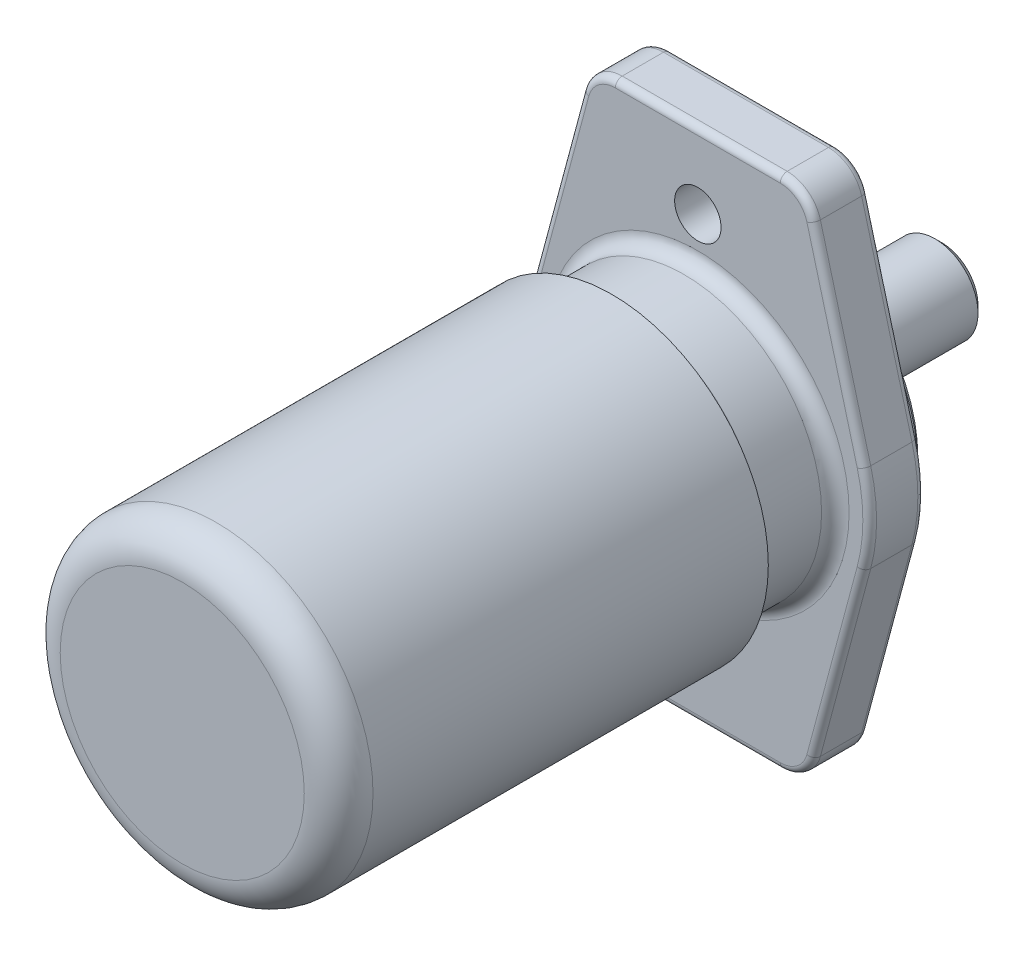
ISO-10303-21;
HEADER;
FILE_DESCRIPTION(('STEP AP214'),'2;1');
FILE_NAME('part.step','',(''),(''),'','','');
FILE_SCHEMA(('AUTOMOTIVE_DESIGN { 1 0 10303 214 1 1 1 1 }'));
ENDSEC;
DATA;
#1=APPLICATION_CONTEXT('core data for automotive mechanical design processes');
#2=APPLICATION_PROTOCOL_DEFINITION('international standard','automotive_design',2000,#1);
#3=PRODUCT_CONTEXT('',#1,'mechanical');
#4=PRODUCT('Part','Part','',(#3));
#5=PRODUCT_RELATED_PRODUCT_CATEGORY('part','',(#4));
#6=PRODUCT_DEFINITION_FORMATION('','',#4);
#7=PRODUCT_DEFINITION_CONTEXT('part definition',#1,'design');
#8=PRODUCT_DEFINITION('design','',#6,#7);
#9=PRODUCT_DEFINITION_SHAPE('','',#8);
#10=(LENGTH_UNIT() NAMED_UNIT(*) SI_UNIT(.MILLI.,.METRE.));
#11=(NAMED_UNIT(*) PLANE_ANGLE_UNIT() SI_UNIT($,.RADIAN.));
#12=(NAMED_UNIT(*) SI_UNIT($,.STERADIAN.) SOLID_ANGLE_UNIT());
#13=UNCERTAINTY_MEASURE_WITH_UNIT(LENGTH_MEASURE(1.E-05),#10,'distance_accuracy_value','');
#14=(GEOMETRIC_REPRESENTATION_CONTEXT(3) GLOBAL_UNCERTAINTY_ASSIGNED_CONTEXT((#13)) GLOBAL_UNIT_ASSIGNED_CONTEXT((#10,
#11,#12)) REPRESENTATION_CONTEXT('',''));
#15=CARTESIAN_POINT('',(0.,0.,0.));
#16=DIRECTION('',(0.,0.,1.));
#17=DIRECTION('',(1.,0.,0.));
#18=AXIS2_PLACEMENT_3D('',#15,#16,#17);
#19=CARTESIAN_POINT('',(0.,0.,24.));
#20=DIRECTION('',(0.,0.,1.));
#21=DIRECTION('',(1.,0.,0.));
#22=AXIS2_PLACEMENT_3D('',#19,#20,#21);
#23=PLANE('',#22);
#24=DIRECTION('',(0.258819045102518,-0.965925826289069,0.));
#25=VECTOR('',#24,1.);
#26=CARTESIAN_POINT('',(-31.7217563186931,-67.0705523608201,24.));
#27=LINE('',#26,#25);
#28=CARTESIAN_POINT('',(-46.3644396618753,-12.4233141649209,24.));
#29=VERTEX_POINT('',#28);
#30=CARTESIAN_POINT('',(-31.7217563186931,-67.0705523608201,24.));
#31=VERTEX_POINT('',#30);
#32=EDGE_CURVE('E226',#29,#31,#27,.T.);
#33=ORIENTED_EDGE('',*,*,#32,.T.);
#34=CARTESIAN_POINT('',(-23.9943497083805,-65.,24.));
#35=DIRECTION('',(0.,0.,1.));
#36=DIRECTION('',(1.,0.,0.));
#37=AXIS2_PLACEMENT_3D('',#34,#35,#36);
#38=CIRCLE('',#37,8.);
#39=CARTESIAN_POINT('',(-23.9943497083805,-73.,24.));
#40=VERTEX_POINT('',#39);
#41=EDGE_CURVE('E240',#31,#40,#38,.T.);
#42=ORIENTED_EDGE('',*,*,#41,.T.);
#43=DIRECTION('',(1.,0.,0.));
#44=VECTOR('',#43,1.);
#45=CARTESIAN_POINT('',(23.9943497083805,-73.,24.));
#46=LINE('',#45,#44);
#47=CARTESIAN_POINT('',(23.9943497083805,-73.,24.));
#48=VERTEX_POINT('',#47);
#49=EDGE_CURVE('E238',#40,#48,#46,.T.);
#50=ORIENTED_EDGE('',*,*,#49,.T.);
#51=CARTESIAN_POINT('',(23.9943497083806,-65.,24.));
#52=DIRECTION('',(0.,0.,1.));
#53=DIRECTION('',(1.,0.,0.));
#54=AXIS2_PLACEMENT_3D('',#51,#52,#53);
#55=CIRCLE('',#54,7.99999999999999);
#56=CARTESIAN_POINT('',(31.7217563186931,-67.0705523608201,24.));
#57=VERTEX_POINT('',#56);
#58=EDGE_CURVE('E236',#48,#57,#55,.T.);
#59=ORIENTED_EDGE('',*,*,#58,.T.);
#60=DIRECTION('',(0.258819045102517,0.965925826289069,0.));
#61=VECTOR('',#60,1.);
#62=CARTESIAN_POINT('',(46.3644396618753,-12.4233141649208,24.));
#63=LINE('',#62,#61);
#64=CARTESIAN_POINT('',(46.3644396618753,-12.4233141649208,24.));
#65=VERTEX_POINT('',#64);
#66=EDGE_CURVE('E234',#57,#65,#63,.T.);
#67=ORIENTED_EDGE('',*,*,#66,.T.);
#68=CARTESIAN_POINT('',(0.,0.,24.));
#69=DIRECTION('',(0.,0.,1.));
#70=DIRECTION('',(1.,0.,0.));
#71=AXIS2_PLACEMENT_3D('',#68,#69,#70);
#72=CIRCLE('',#71,48.);
#73=CARTESIAN_POINT('',(46.3644396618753,12.4233141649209,24.));
#74=VERTEX_POINT('',#73);
#75=EDGE_CURVE('E232',#65,#74,#72,.T.);
#76=ORIENTED_EDGE('',*,*,#75,.T.);
#77=DIRECTION('',(-0.258819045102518,0.965925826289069,0.));
#78=VECTOR('',#77,1.);
#79=CARTESIAN_POINT('',(31.7217563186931,67.0705523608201,24.));
#80=LINE('',#79,#78);
#81=CARTESIAN_POINT('',(31.7217563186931,67.0705523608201,24.));
#82=VERTEX_POINT('',#81);
#83=EDGE_CURVE('E230',#74,#82,#80,.T.);
#84=ORIENTED_EDGE('',*,*,#83,.T.);
#85=CARTESIAN_POINT('',(23.9943497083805,65.,24.));
#86=DIRECTION('',(0.,0.,1.));
#87=DIRECTION('',(1.,0.,0.));
#88=AXIS2_PLACEMENT_3D('',#85,#86,#87);
#89=CIRCLE('',#88,8.);
#90=CARTESIAN_POINT('',(23.9943497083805,73.,24.));
#91=VERTEX_POINT('',#90);
#92=EDGE_CURVE('E228',#82,#91,#89,.T.);
#93=ORIENTED_EDGE('',*,*,#92,.T.);
#94=DIRECTION('',(-1.,0.,0.));
#95=VECTOR('',#94,1.);
#96=CARTESIAN_POINT('',(-23.9943497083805,73.,24.));
#97=LINE('',#96,#95);
#98=CARTESIAN_POINT('',(-23.9943497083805,73.,24.));
#99=VERTEX_POINT('',#98);
#100=EDGE_CURVE('E224',#91,#99,#97,.T.);
#101=ORIENTED_EDGE('',*,*,#100,.T.);
#102=CARTESIAN_POINT('',(-23.9943497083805,65.,24.));
#103=DIRECTION('',(0.,0.,1.));
#104=DIRECTION('',(1.,0.,0.));
#105=AXIS2_PLACEMENT_3D('',#102,#103,#104);
#106=CIRCLE('',#105,7.99999999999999);
#107=CARTESIAN_POINT('',(-31.7217563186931,67.0705523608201,24.));
#108=VERTEX_POINT('',#107);
#109=EDGE_CURVE('E199',#99,#108,#106,.T.);
#110=ORIENTED_EDGE('',*,*,#109,.T.);
#111=DIRECTION('',(-0.258819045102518,-0.965925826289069,0.));
#112=VECTOR('',#111,1.);
#113=CARTESIAN_POINT('',(-46.3644396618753,12.4233141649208,24.));
#114=LINE('',#113,#112);
#115=CARTESIAN_POINT('',(-46.3644396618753,12.4233141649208,24.));
#116=VERTEX_POINT('',#115);
#117=EDGE_CURVE('E191',#108,#116,#114,.T.);
#118=ORIENTED_EDGE('',*,*,#117,.T.);
#119=CARTESIAN_POINT('',(0.,0.,24.));
#120=DIRECTION('',(0.,0.,1.));
#121=DIRECTION('',(1.,0.,0.));
#122=AXIS2_PLACEMENT_3D('',#119,#120,#121);
#123=CIRCLE('',#122,48.);
#124=EDGE_CURVE('E196',#116,#29,#123,.T.);
#125=ORIENTED_EDGE('',*,*,#124,.T.);
#126=EDGE_LOOP('',(#33,#42,#50,#59,#67,#76,#84,#93,#101,#110,#118,#125));
#127=FACE_BOUND('',#126,.T.);
#128=CARTESIAN_POINT('',(0.,0.,24.));
#129=DIRECTION('',(0.,0.,1.));
#130=DIRECTION('',(1.,0.,0.));
#131=AXIS2_PLACEMENT_3D('',#128,#129,#130);
#132=CIRCLE('',#131,44.);
#133=CARTESIAN_POINT('',(44.,0.,24.));
#134=VERTEX_POINT('',#133);
#135=EDGE_CURVE('E219',#134,#134,#132,.F.);
#136=ORIENTED_EDGE('',*,*,#135,.T.);
#137=EDGE_LOOP('',(#136));
#138=FACE_BOUND('',#137,.T.);
#139=CARTESIAN_POINT('',(0.,-53.2,24.));
#140=DIRECTION('',(0.,0.,1.));
#141=DIRECTION('',(1.,0.,0.));
#142=AXIS2_PLACEMENT_3D('',#139,#140,#141);
#143=CIRCLE('',#142,6.75);
#144=CARTESIAN_POINT('',(6.75,-53.2,24.));
#145=VERTEX_POINT('',#144);
#146=EDGE_CURVE('E530',#145,#145,#143,.T.);
#147=ORIENTED_EDGE('',*,*,#146,.F.);
#148=EDGE_LOOP('',(#147));
#149=FACE_BOUND('',#148,.T.);
#150=CARTESIAN_POINT('',(0.,53.2,24.));
#151=DIRECTION('',(0.,0.,1.));
#152=DIRECTION('',(1.,0.,0.));
#153=AXIS2_PLACEMENT_3D('',#150,#151,#152);
#154=CIRCLE('',#153,6.75);
#155=CARTESIAN_POINT('',(6.75,53.2,24.));
#156=VERTEX_POINT('',#155);
#157=EDGE_CURVE('E458',#156,#156,#154,.T.);
#158=ORIENTED_EDGE('',*,*,#157,.F.);
#159=EDGE_LOOP('',(#158));
#160=FACE_BOUND('',#159,.T.);
#161=ADVANCED_FACE('F29',(#127,#138,#149,#160),#23,.T.);
#162=CARTESIAN_POINT('',(0.,0.,0.));
#163=DIRECTION('',(0.,0.,1.));
#164=DIRECTION('',(1.,0.,0.));
#165=AXIS2_PLACEMENT_3D('',#162,#163,#164);
#166=PLANE('',#165);
#167=CARTESIAN_POINT('',(0.,0.,0.));
#168=DIRECTION('',(0.,0.,1.));
#169=DIRECTION('',(1.,0.,0.));
#170=AXIS2_PLACEMENT_3D('',#167,#168,#169);
#171=CIRCLE('',#170,14.5);
#172=CARTESIAN_POINT('',(14.5,0.,0.));
#173=VERTEX_POINT('',#172);
#174=EDGE_CURVE('E323',#173,#173,#171,.T.);
#175=ORIENTED_EDGE('',*,*,#174,.T.);
#176=EDGE_LOOP('',(#175));
#177=FACE_BOUND('',#176,.T.);
#178=CARTESIAN_POINT('',(0.,0.,0.));
#179=DIRECTION('',(0.,0.,1.));
#180=DIRECTION('',(1.,0.,0.));
#181=AXIS2_PLACEMENT_3D('',#178,#179,#180);
#182=CIRCLE('',#181,40.);
#183=CARTESIAN_POINT('',(40.,0.,0.));
#184=VERTEX_POINT('',#183);
#185=EDGE_CURVE('E320',#184,#184,#182,.F.);
#186=ORIENTED_EDGE('',*,*,#185,.T.);
#187=EDGE_LOOP('',(#186));
#188=FACE_BOUND('',#187,.T.);
#189=ADVANCED_FACE('F347',(#177,#188),#166,.F.);
#190=CARTESIAN_POINT('',(0.,0.,8.));
#191=DIRECTION('',(0.,0.,-1.));
#192=DIRECTION('',(-1.,0.,0.));
#193=AXIS2_PLACEMENT_3D('',#190,#191,#192);
#194=CYLINDRICAL_SURFACE('',#193,42.);
#195=CARTESIAN_POINT('',(0.,0.,2.));
#196=DIRECTION('',(0.,0.,1.));
#197=DIRECTION('',(1.,0.,0.));
#198=AXIS2_PLACEMENT_3D('',#195,#196,#197);
#199=CIRCLE('',#198,42.);
#200=CARTESIAN_POINT('',(42.,0.,2.));
#201=VERTEX_POINT('',#200);
#202=EDGE_CURVE('E11',#201,#201,#199,.T.);
#203=ORIENTED_EDGE('',*,*,#202,.T.);
#204=EDGE_LOOP('',(#203));
#205=FACE_BOUND('',#204,.T.);
#206=CARTESIAN_POINT('',(0.,0.,8.));
#207=DIRECTION('',(0.,0.,1.));
#208=DIRECTION('',(1.,0.,0.));
#209=AXIS2_PLACEMENT_3D('',#206,#207,#208);
#210=CIRCLE('',#209,42.);
#211=CARTESIAN_POINT('',(42.,0.,8.));
#212=VERTEX_POINT('',#211);
#213=EDGE_CURVE('E416',#212,#212,#210,.T.);
#214=ORIENTED_EDGE('',*,*,#213,.F.);
#215=EDGE_LOOP('',(#214));
#216=FACE_BOUND('',#215,.T.);
#217=ADVANCED_FACE('F31',(#205,#216),#194,.T.);
#218=CARTESIAN_POINT('',(0.,0.,8.));
#219=DIRECTION('',(0.,0.,1.));
#220=DIRECTION('',(1.,0.,0.));
#221=AXIS2_PLACEMENT_3D('',#218,#219,#220);
#222=PLANE('',#221);
#223=DIRECTION('',(1.,0.,0.));
#224=VECTOR('',#223,1.);
#225=CARTESIAN_POINT('',(0.,-73.,8.));
#226=LINE('',#225,#224);
#227=CARTESIAN_POINT('',(23.9943497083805,-73.,8.));
#228=VERTEX_POINT('',#227);
#229=CARTESIAN_POINT('',(-23.9943497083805,-73.,8.));
#230=VERTEX_POINT('',#229);
#231=EDGE_CURVE('E269',#228,#230,#226,.F.);
#232=ORIENTED_EDGE('',*,*,#231,.T.);
#233=CARTESIAN_POINT('',(-23.9943497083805,-65.,8.));
#234=DIRECTION('',(0.,0.,1.));
#235=DIRECTION('',(1.,0.,0.));
#236=AXIS2_PLACEMENT_3D('',#233,#234,#235);
#237=CIRCLE('',#236,8.);
#238=CARTESIAN_POINT('',(-31.7217563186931,-67.0705523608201,8.));
#239=VERTEX_POINT('',#238);
#240=EDGE_CURVE('E271',#230,#239,#237,.F.);
#241=ORIENTED_EDGE('',*,*,#240,.T.);
#242=DIRECTION('',(0.258819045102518,-0.965925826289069,0.));
#243=VECTOR('',#242,1.);
#244=CARTESIAN_POINT('',(-46.3644396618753,-12.4233141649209,8.));
#245=LINE('',#244,#243);
#246=CARTESIAN_POINT('',(-46.3644396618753,-12.4233141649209,8.));
#247=VERTEX_POINT('',#246);
#248=EDGE_CURVE('E256',#239,#247,#245,.F.);
#249=ORIENTED_EDGE('',*,*,#248,.T.);
#250=CARTESIAN_POINT('',(0.,0.,8.));
#251=DIRECTION('',(0.,0.,1.));
#252=DIRECTION('',(1.,0.,0.));
#253=AXIS2_PLACEMENT_3D('',#250,#251,#252);
#254=CIRCLE('',#253,48.);
#255=CARTESIAN_POINT('',(-46.3644396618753,12.4233141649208,8.));
#256=VERTEX_POINT('',#255);
#257=EDGE_CURVE('E248',#247,#256,#254,.F.);
#258=ORIENTED_EDGE('',*,*,#257,.T.);
#259=DIRECTION('',(-0.258819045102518,-0.965925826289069,0.));
#260=VECTOR('',#259,1.);
#261=CARTESIAN_POINT('',(-46.3644396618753,12.4233141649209,8.));
#262=LINE('',#261,#260);
#263=CARTESIAN_POINT('',(-31.7217563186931,67.0705523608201,8.));
#264=VERTEX_POINT('',#263);
#265=EDGE_CURVE('E250',#256,#264,#262,.F.);
#266=ORIENTED_EDGE('',*,*,#265,.T.);
#267=CARTESIAN_POINT('',(-23.9943497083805,65.,8.));
#268=DIRECTION('',(0.,0.,1.));
#269=DIRECTION('',(1.,0.,0.));
#270=AXIS2_PLACEMENT_3D('',#267,#268,#269);
#271=CIRCLE('',#270,7.99999999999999);
#272=CARTESIAN_POINT('',(-23.9943497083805,73.,8.));
#273=VERTEX_POINT('',#272);
#274=EDGE_CURVE('E252',#264,#273,#271,.F.);
#275=ORIENTED_EDGE('',*,*,#274,.T.);
#276=DIRECTION('',(-1.,0.,0.));
#277=VECTOR('',#276,1.);
#278=CARTESIAN_POINT('',(0.,73.,8.));
#279=LINE('',#278,#277);
#280=CARTESIAN_POINT('',(23.9943497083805,73.,8.));
#281=VERTEX_POINT('',#280);
#282=EDGE_CURVE('E254',#273,#281,#279,.F.);
#283=ORIENTED_EDGE('',*,*,#282,.T.);
#284=CARTESIAN_POINT('',(23.9943497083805,65.,8.));
#285=DIRECTION('',(0.,0.,1.));
#286=DIRECTION('',(1.,0.,0.));
#287=AXIS2_PLACEMENT_3D('',#284,#285,#286);
#288=CIRCLE('',#287,8.);
#289=CARTESIAN_POINT('',(31.7217563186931,67.0705523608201,8.));
#290=VERTEX_POINT('',#289);
#291=EDGE_CURVE('E259',#281,#290,#288,.F.);
#292=ORIENTED_EDGE('',*,*,#291,.T.);
#293=DIRECTION('',(-0.258819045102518,0.965925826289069,0.));
#294=VECTOR('',#293,1.);
#295=CARTESIAN_POINT('',(46.3644396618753,12.4233141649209,8.));
#296=LINE('',#295,#294);
#297=CARTESIAN_POINT('',(46.3644396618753,12.4233141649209,8.));
#298=VERTEX_POINT('',#297);
#299=EDGE_CURVE('E261',#290,#298,#296,.F.);
#300=ORIENTED_EDGE('',*,*,#299,.T.);
#301=CARTESIAN_POINT('',(0.,0.,8.));
#302=DIRECTION('',(0.,0.,1.));
#303=DIRECTION('',(1.,0.,0.));
#304=AXIS2_PLACEMENT_3D('',#301,#302,#303);
#305=CIRCLE('',#304,48.);
#306=CARTESIAN_POINT('',(46.3644396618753,-12.4233141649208,8.));
#307=VERTEX_POINT('',#306);
#308=EDGE_CURVE('E263',#298,#307,#305,.F.);
#309=ORIENTED_EDGE('',*,*,#308,.T.);
#310=DIRECTION('',(0.258819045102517,0.965925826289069,0.));
#311=VECTOR('',#310,1.);
#312=CARTESIAN_POINT('',(46.3644396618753,-12.4233141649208,8.));
#313=LINE('',#312,#311);
#314=CARTESIAN_POINT('',(31.7217563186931,-67.0705523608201,8.));
#315=VERTEX_POINT('',#314);
#316=EDGE_CURVE('E265',#307,#315,#313,.F.);
#317=ORIENTED_EDGE('',*,*,#316,.T.);
#318=CARTESIAN_POINT('',(23.9943497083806,-65.,8.));
#319=DIRECTION('',(0.,0.,1.));
#320=DIRECTION('',(1.,0.,0.));
#321=AXIS2_PLACEMENT_3D('',#318,#319,#320);
#322=CIRCLE('',#321,7.99999999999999);
#323=EDGE_CURVE('E267',#315,#228,#322,.F.);
#324=ORIENTED_EDGE('',*,*,#323,.T.);
#325=EDGE_LOOP('',(#232,#241,#249,#258,#266,#275,#283,#292,#300,#309,#317,#324));
#326=FACE_BOUND('',#325,.T.);
#327=CARTESIAN_POINT('',(0.,-53.2,8.));
#328=DIRECTION('',(0.,0.,1.));
#329=DIRECTION('',(1.,0.,0.));
#330=AXIS2_PLACEMENT_3D('',#327,#328,#329);
#331=CIRCLE('',#330,6.75);
#332=CARTESIAN_POINT('',(6.75,-53.2,8.));
#333=VERTEX_POINT('',#332);
#334=EDGE_CURVE('E527',#333,#333,#331,.T.);
#335=ORIENTED_EDGE('',*,*,#334,.T.);
#336=EDGE_LOOP('',(#335));
#337=FACE_BOUND('',#336,.T.);
#338=CARTESIAN_POINT('',(0.,53.2,8.));
#339=DIRECTION('',(0.,0.,1.));
#340=DIRECTION('',(1.,0.,0.));
#341=AXIS2_PLACEMENT_3D('',#338,#339,#340);
#342=CIRCLE('',#341,6.75);
#343=CARTESIAN_POINT('',(6.75,53.2,8.));
#344=VERTEX_POINT('',#343);
#345=EDGE_CURVE('E536',#344,#344,#342,.T.);
#346=ORIENTED_EDGE('',*,*,#345,.T.);
#347=EDGE_LOOP('',(#346));
#348=FACE_BOUND('',#347,.T.);
#349=ORIENTED_EDGE('',*,*,#213,.T.);
#350=EDGE_LOOP('',(#349));
#351=FACE_BOUND('',#350,.T.);
#352=ADVANCED_FACE('F355',(#326,#337,#348,#351),#222,.F.);
#353=CARTESIAN_POINT('',(0.,0.,24.));
#354=DIRECTION('',(0.,0.,-1.));
#355=DIRECTION('',(-1.,0.,0.));
#356=AXIS2_PLACEMENT_3D('',#353,#354,#355);
#357=CYLINDRICAL_SURFACE('',#356,50.);
#358=DIRECTION('',(0.,0.,-1.));
#359=VECTOR('',#358,1.);
#360=CARTESIAN_POINT('',(48.2962913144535,12.9409522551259,24.));
#361=LINE('',#360,#359);
#362=CARTESIAN_POINT('',(48.2962913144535,12.9409522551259,22.));
#363=VERTEX_POINT('',#362);
#364=CARTESIAN_POINT('',(48.2962913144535,12.9409522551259,10.));
#365=VERTEX_POINT('',#364);
#366=EDGE_CURVE('E409',#363,#365,#361,.T.);
#367=ORIENTED_EDGE('',*,*,#366,.F.);
#368=CARTESIAN_POINT('',(0.,0.,22.));
#369=DIRECTION('',(0.,0.,1.));
#370=DIRECTION('',(1.,0.,0.));
#371=AXIS2_PLACEMENT_3D('',#368,#369,#370);
#372=CIRCLE('',#371,50.);
#373=CARTESIAN_POINT('',(48.2962913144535,-12.9409522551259,22.));
#374=VERTEX_POINT('',#373);
#375=EDGE_CURVE('E291',#363,#374,#372,.F.);
#376=ORIENTED_EDGE('',*,*,#375,.T.);
#377=DIRECTION('',(0.,0.,-1.));
#378=VECTOR('',#377,1.);
#379=CARTESIAN_POINT('',(48.2962913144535,-12.9409522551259,24.));
#380=LINE('',#379,#378);
#381=CARTESIAN_POINT('',(48.2962913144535,-12.9409522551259,10.));
#382=VERTEX_POINT('',#381);
#383=EDGE_CURVE('E450',#374,#382,#380,.T.);
#384=ORIENTED_EDGE('',*,*,#383,.T.);
#385=CARTESIAN_POINT('',(0.,0.,10.));
#386=DIRECTION('',(0.,0.,1.));
#387=DIRECTION('',(1.,0.,0.));
#388=AXIS2_PLACEMENT_3D('',#385,#386,#387);
#389=CIRCLE('',#388,50.);
#390=EDGE_CURVE('E289',#382,#365,#389,.T.);
#391=ORIENTED_EDGE('',*,*,#390,.T.);
#392=EDGE_LOOP('',(#367,#376,#384,#391));
#393=FACE_BOUND('',#392,.T.);
#394=ADVANCED_FACE('F399',(#393),#357,.T.);
#395=CARTESIAN_POINT('',(33.6536079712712,67.5881904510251,24.));
#396=DIRECTION('',(-0.965925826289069,-0.258819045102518,0.));
#397=DIRECTION('',(0.258819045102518,-0.965925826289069,0.));
#398=AXIS2_PLACEMENT_3D('',#395,#396,#397);
#399=PLANE('',#398);
#400=DIRECTION('',(0.,0.,-1.));
#401=VECTOR('',#400,1.);
#402=CARTESIAN_POINT('',(33.6536079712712,67.5881904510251,24.));
#403=LINE('',#402,#401);
#404=CARTESIAN_POINT('',(33.6536079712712,67.5881904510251,22.));
#405=VERTEX_POINT('',#404);
#406=CARTESIAN_POINT('',(33.6536079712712,67.5881904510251,10.));
#407=VERTEX_POINT('',#406);
#408=EDGE_CURVE('E417',#405,#407,#403,.T.);
#409=ORIENTED_EDGE('',*,*,#408,.F.);
#410=DIRECTION('',(-0.258819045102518,0.965925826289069,0.));
#411=VECTOR('',#410,1.);
#412=CARTESIAN_POINT('',(48.2962913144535,12.9409522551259,22.));
#413=LINE('',#412,#411);
#414=EDGE_CURVE('E295',#405,#363,#413,.F.);
#415=ORIENTED_EDGE('',*,*,#414,.T.);
#416=ORIENTED_EDGE('',*,*,#366,.T.);
#417=DIRECTION('',(-0.258819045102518,0.965925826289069,0.));
#418=VECTOR('',#417,1.);
#419=CARTESIAN_POINT('',(33.6536079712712,67.5881904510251,10.));
#420=LINE('',#419,#418);
#421=EDGE_CURVE('E293',#365,#407,#420,.T.);
#422=ORIENTED_EDGE('',*,*,#421,.T.);
#423=EDGE_LOOP('',(#409,#415,#416,#422));
#424=FACE_BOUND('',#423,.T.);
#425=ADVANCED_FACE('F395',(#424),#399,.F.);
#426=CARTESIAN_POINT('',(23.9943497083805,65.,24.));
#427=DIRECTION('',(0.,0.,-1.));
#428=DIRECTION('',(-1.,0.,0.));
#429=AXIS2_PLACEMENT_3D('',#426,#427,#428);
#430=CYLINDRICAL_SURFACE('',#429,10.);
#431=DIRECTION('',(0.,0.,-1.));
#432=VECTOR('',#431,1.);
#433=CARTESIAN_POINT('',(23.9943497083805,75.,24.));
#434=LINE('',#433,#432);
#435=CARTESIAN_POINT('',(23.9943497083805,75.,22.));
#436=VERTEX_POINT('',#435);
#437=CARTESIAN_POINT('',(23.9943497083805,75.,10.));
#438=VERTEX_POINT('',#437);
#439=EDGE_CURVE('E477',#436,#438,#434,.T.);
#440=ORIENTED_EDGE('',*,*,#439,.F.);
#441=CARTESIAN_POINT('',(23.9943497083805,65.,22.));
#442=DIRECTION('',(0.,0.,1.));
#443=DIRECTION('',(1.,0.,0.));
#444=AXIS2_PLACEMENT_3D('',#441,#442,#443);
#445=CIRCLE('',#444,10.);
#446=EDGE_CURVE('E303',#436,#405,#445,.F.);
#447=ORIENTED_EDGE('',*,*,#446,.T.);
#448=ORIENTED_EDGE('',*,*,#408,.T.);
#449=CARTESIAN_POINT('',(23.9943497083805,65.,10.));
#450=DIRECTION('',(0.,0.,1.));
#451=DIRECTION('',(1.,0.,0.));
#452=AXIS2_PLACEMENT_3D('',#449,#450,#451);
#453=CIRCLE('',#452,10.);
#454=EDGE_CURVE('E301',#407,#438,#453,.T.);
#455=ORIENTED_EDGE('',*,*,#454,.T.);
#456=EDGE_LOOP('',(#440,#447,#448,#455));
#457=FACE_BOUND('',#456,.T.);
#458=ADVANCED_FACE('F391',(#457),#430,.T.);
#459=CARTESIAN_POINT('',(-23.9943497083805,75.,24.));
#460=DIRECTION('',(0.,-1.,0.));
#461=DIRECTION('',(1.,0.,0.));
#462=AXIS2_PLACEMENT_3D('',#459,#460,#461);
#463=PLANE('',#462);
#464=DIRECTION('',(0.,0.,-1.));
#465=VECTOR('',#464,1.);
#466=CARTESIAN_POINT('',(-23.9943497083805,75.,24.));
#467=LINE('',#466,#465);
#468=CARTESIAN_POINT('',(-23.9943497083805,75.,22.));
#469=VERTEX_POINT('',#468);
#470=CARTESIAN_POINT('',(-23.9943497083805,75.,10.));
#471=VERTEX_POINT('',#470);
#472=EDGE_CURVE('E474',#469,#471,#467,.T.);
#473=ORIENTED_EDGE('',*,*,#472,.F.);
#474=DIRECTION('',(-1.,0.,0.));
#475=VECTOR('',#474,1.);
#476=CARTESIAN_POINT('',(23.9943497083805,75.,22.));
#477=LINE('',#476,#475);
#478=EDGE_CURVE('E299',#469,#436,#477,.F.);
#479=ORIENTED_EDGE('',*,*,#478,.T.);
#480=ORIENTED_EDGE('',*,*,#439,.T.);
#481=DIRECTION('',(-1.,0.,0.));
#482=VECTOR('',#481,1.);
#483=CARTESIAN_POINT('',(-23.9943497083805,75.,10.));
#484=LINE('',#483,#482);
#485=EDGE_CURVE('E297',#438,#471,#484,.T.);
#486=ORIENTED_EDGE('',*,*,#485,.T.);
#487=EDGE_LOOP('',(#473,#479,#480,#486));
#488=FACE_BOUND('',#487,.T.);
#489=ADVANCED_FACE('F387',(#488),#463,.F.);
#490=CARTESIAN_POINT('',(-23.9943497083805,65.,24.));
#491=DIRECTION('',(0.,0.,-1.));
#492=DIRECTION('',(-1.,0.,0.));
#493=AXIS2_PLACEMENT_3D('',#490,#491,#492);
#494=CYLINDRICAL_SURFACE('',#493,9.99999999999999);
#495=DIRECTION('',(0.,0.,-1.));
#496=VECTOR('',#495,1.);
#497=CARTESIAN_POINT('',(-33.6536079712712,67.5881904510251,24.));
#498=LINE('',#497,#496);
#499=CARTESIAN_POINT('',(-33.6536079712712,67.5881904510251,22.));
#500=VERTEX_POINT('',#499);
#501=CARTESIAN_POINT('',(-33.6536079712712,67.5881904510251,10.));
#502=VERTEX_POINT('',#501);
#503=EDGE_CURVE('E472',#500,#502,#498,.T.);
#504=ORIENTED_EDGE('',*,*,#503,.F.);
#505=CARTESIAN_POINT('',(-23.9943497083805,65.,22.));
#506=DIRECTION('',(0.,0.,1.));
#507=DIRECTION('',(1.,0.,0.));
#508=AXIS2_PLACEMENT_3D('',#505,#506,#507);
#509=CIRCLE('',#508,9.99999999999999);
#510=EDGE_CURVE('E307',#500,#469,#509,.F.);
#511=ORIENTED_EDGE('',*,*,#510,.T.);
#512=ORIENTED_EDGE('',*,*,#472,.T.);
#513=CARTESIAN_POINT('',(-23.9943497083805,65.,10.));
#514=DIRECTION('',(0.,0.,1.));
#515=DIRECTION('',(1.,0.,0.));
#516=AXIS2_PLACEMENT_3D('',#513,#514,#515);
#517=CIRCLE('',#516,9.99999999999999);
#518=EDGE_CURVE('E305',#471,#502,#517,.T.);
#519=ORIENTED_EDGE('',*,*,#518,.T.);
#520=EDGE_LOOP('',(#504,#511,#512,#519));
#521=FACE_BOUND('',#520,.T.);
#522=ADVANCED_FACE('F384',(#521),#494,.T.);
#523=CARTESIAN_POINT('',(-48.2962913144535,12.9409522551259,24.));
#524=DIRECTION('',(0.965925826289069,-0.258819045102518,0.));
#525=DIRECTION('',(0.258819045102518,0.965925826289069,0.));
#526=AXIS2_PLACEMENT_3D('',#523,#524,#525);
#527=PLANE('',#526);
#528=DIRECTION('',(0.,0.,-1.));
#529=VECTOR('',#528,1.);
#530=CARTESIAN_POINT('',(-48.2962913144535,12.9409522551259,24.));
#531=LINE('',#530,#529);
#532=CARTESIAN_POINT('',(-48.2962913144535,12.9409522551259,22.));
#533=VERTEX_POINT('',#532);
#534=CARTESIAN_POINT('',(-48.2962913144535,12.9409522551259,10.));
#535=VERTEX_POINT('',#534);
#536=EDGE_CURVE('E470',#533,#535,#531,.T.);
#537=ORIENTED_EDGE('',*,*,#536,.F.);
#538=DIRECTION('',(-0.258819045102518,-0.965925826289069,0.));
#539=VECTOR('',#538,1.);
#540=CARTESIAN_POINT('',(-33.6536079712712,67.5881904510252,22.));
#541=LINE('',#540,#539);
#542=EDGE_CURVE('E208',#533,#500,#541,.F.);
#543=ORIENTED_EDGE('',*,*,#542,.T.);
#544=ORIENTED_EDGE('',*,*,#503,.T.);
#545=DIRECTION('',(-0.258819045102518,-0.965925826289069,0.));
#546=VECTOR('',#545,1.);
#547=CARTESIAN_POINT('',(-48.2962913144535,12.9409522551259,10.));
#548=LINE('',#547,#546);
#549=EDGE_CURVE('E44',#502,#535,#548,.T.);
#550=ORIENTED_EDGE('',*,*,#549,.T.);
#551=EDGE_LOOP('',(#537,#543,#544,#550));
#552=FACE_BOUND('',#551,.T.);
#553=ADVANCED_FACE('F381',(#552),#527,.F.);
#554=CARTESIAN_POINT('',(0.,0.,24.));
#555=DIRECTION('',(0.,0.,-1.));
#556=DIRECTION('',(-1.,0.,0.));
#557=AXIS2_PLACEMENT_3D('',#554,#555,#556);
#558=CYLINDRICAL_SURFACE('',#557,50.);
#559=DIRECTION('',(0.,0.,-1.));
#560=VECTOR('',#559,1.);
#561=CARTESIAN_POINT('',(-48.2962913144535,-12.9409522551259,24.));
#562=LINE('',#561,#560);
#563=CARTESIAN_POINT('',(-48.2962913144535,-12.9409522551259,22.));
#564=VERTEX_POINT('',#563);
#565=CARTESIAN_POINT('',(-48.2962913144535,-12.9409522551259,10.));
#566=VERTEX_POINT('',#565);
#567=EDGE_CURVE('E467',#564,#566,#562,.T.);
#568=ORIENTED_EDGE('',*,*,#567,.F.);
#569=CARTESIAN_POINT('',(0.,0.,22.));
#570=DIRECTION('',(0.,0.,1.));
#571=DIRECTION('',(1.,0.,0.));
#572=AXIS2_PLACEMENT_3D('',#569,#570,#571);
#573=CIRCLE('',#572,50.);
#574=EDGE_CURVE('E51',#564,#533,#573,.F.);
#575=ORIENTED_EDGE('',*,*,#574,.T.);
#576=ORIENTED_EDGE('',*,*,#536,.T.);
#577=CARTESIAN_POINT('',(0.,0.,10.));
#578=DIRECTION('',(0.,0.,1.));
#579=DIRECTION('',(1.,0.,0.));
#580=AXIS2_PLACEMENT_3D('',#577,#578,#579);
#581=CIRCLE('',#580,50.);
#582=EDGE_CURVE('E311',#535,#566,#581,.T.);
#583=ORIENTED_EDGE('',*,*,#582,.T.);
#584=EDGE_LOOP('',(#568,#575,#576,#583));
#585=FACE_BOUND('',#584,.T.);
#586=ADVANCED_FACE('F377',(#585),#558,.T.);
#587=CARTESIAN_POINT('',(-48.2962913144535,-12.9409522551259,24.));
#588=DIRECTION('',(0.965925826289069,0.258819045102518,0.));
#589=DIRECTION('',(-0.258819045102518,0.965925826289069,0.));
#590=AXIS2_PLACEMENT_3D('',#587,#588,#589);
#591=PLANE('',#590);
#592=DIRECTION('',(0.,0.,-1.));
#593=VECTOR('',#592,1.);
#594=CARTESIAN_POINT('',(-33.6536079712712,-67.5881904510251,24.));
#595=LINE('',#594,#593);
#596=CARTESIAN_POINT('',(-33.6536079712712,-67.5881904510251,22.));
#597=VERTEX_POINT('',#596);
#598=CARTESIAN_POINT('',(-33.6536079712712,-67.5881904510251,10.));
#599=VERTEX_POINT('',#598);
#600=EDGE_CURVE('E464',#597,#599,#595,.T.);
#601=ORIENTED_EDGE('',*,*,#600,.F.);
#602=DIRECTION('',(0.258819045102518,-0.965925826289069,0.));
#603=VECTOR('',#602,1.);
#604=CARTESIAN_POINT('',(-48.2962913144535,-12.9409522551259,22.));
#605=LINE('',#604,#603);
#606=EDGE_CURVE('E245',#597,#564,#605,.F.);
#607=ORIENTED_EDGE('',*,*,#606,.T.);
#608=ORIENTED_EDGE('',*,*,#567,.T.);
#609=DIRECTION('',(0.258819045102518,-0.965925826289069,0.));
#610=VECTOR('',#609,1.);
#611=CARTESIAN_POINT('',(-48.2962913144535,-12.9409522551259,10.));
#612=LINE('',#611,#610);
#613=EDGE_CURVE('E242',#566,#599,#612,.T.);
#614=ORIENTED_EDGE('',*,*,#613,.T.);
#615=EDGE_LOOP('',(#601,#607,#608,#614));
#616=FACE_BOUND('',#615,.T.);
#617=ADVANCED_FACE('F373',(#616),#591,.F.);
#618=CARTESIAN_POINT('',(-23.9943497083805,-65.,24.));
#619=DIRECTION('',(0.,0.,-1.));
#620=DIRECTION('',(-1.,0.,0.));
#621=AXIS2_PLACEMENT_3D('',#618,#619,#620);
#622=CYLINDRICAL_SURFACE('',#621,10.);
#623=DIRECTION('',(0.,0.,-1.));
#624=VECTOR('',#623,1.);
#625=CARTESIAN_POINT('',(-23.9943497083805,-75.,24.));
#626=LINE('',#625,#624);
#627=CARTESIAN_POINT('',(-23.9943497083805,-75.,22.));
#628=VERTEX_POINT('',#627);
#629=CARTESIAN_POINT('',(-23.9943497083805,-75.,10.));
#630=VERTEX_POINT('',#629);
#631=EDGE_CURVE('E456',#628,#630,#626,.T.);
#632=ORIENTED_EDGE('',*,*,#631,.F.);
#633=CARTESIAN_POINT('',(-23.9943497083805,-65.,22.));
#634=DIRECTION('',(0.,0.,1.));
#635=DIRECTION('',(1.,0.,0.));
#636=AXIS2_PLACEMENT_3D('',#633,#634,#635);
#637=CIRCLE('',#636,10.);
#638=EDGE_CURVE('E275',#628,#597,#637,.F.);
#639=ORIENTED_EDGE('',*,*,#638,.T.);
#640=ORIENTED_EDGE('',*,*,#600,.T.);
#641=CARTESIAN_POINT('',(-23.9943497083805,-65.,10.));
#642=DIRECTION('',(0.,0.,1.));
#643=DIRECTION('',(1.,0.,0.));
#644=AXIS2_PLACEMENT_3D('',#641,#642,#643);
#645=CIRCLE('',#644,10.);
#646=EDGE_CURVE('E273',#599,#630,#645,.T.);
#647=ORIENTED_EDGE('',*,*,#646,.T.);
#648=EDGE_LOOP('',(#632,#639,#640,#647));
#649=FACE_BOUND('',#648,.T.);
#650=ADVANCED_FACE('F369',(#649),#622,.T.);
#651=CARTESIAN_POINT('',(-23.9943497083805,-75.,24.));
#652=DIRECTION('',(0.,1.,0.));
#653=DIRECTION('',(0.,0.,1.));
#654=AXIS2_PLACEMENT_3D('',#651,#652,#653);
#655=PLANE('',#654);
#656=DIRECTION('',(0.,0.,-1.));
#657=VECTOR('',#656,1.);
#658=CARTESIAN_POINT('',(23.9943497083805,-75.,24.));
#659=LINE('',#658,#657);
#660=CARTESIAN_POINT('',(23.9943497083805,-75.,22.));
#661=VERTEX_POINT('',#660);
#662=CARTESIAN_POINT('',(23.9943497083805,-75.,10.));
#663=VERTEX_POINT('',#662);
#664=EDGE_CURVE('E454',#661,#663,#659,.T.);
#665=ORIENTED_EDGE('',*,*,#664,.F.);
#666=DIRECTION('',(1.,0.,0.));
#667=VECTOR('',#666,1.);
#668=CARTESIAN_POINT('',(-23.9943497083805,-75.,22.));
#669=LINE('',#668,#667);
#670=EDGE_CURVE('E279',#661,#628,#669,.F.);
#671=ORIENTED_EDGE('',*,*,#670,.T.);
#672=ORIENTED_EDGE('',*,*,#631,.T.);
#673=DIRECTION('',(1.,0.,0.));
#674=VECTOR('',#673,1.);
#675=CARTESIAN_POINT('',(-23.9943497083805,-75.,10.));
#676=LINE('',#675,#674);
#677=EDGE_CURVE('E277',#630,#663,#676,.T.);
#678=ORIENTED_EDGE('',*,*,#677,.T.);
#679=EDGE_LOOP('',(#665,#671,#672,#678));
#680=FACE_BOUND('',#679,.T.);
#681=ADVANCED_FACE('F365',(#680),#655,.F.);
#682=CARTESIAN_POINT('',(23.9943497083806,-65.,24.));
#683=DIRECTION('',(0.,0.,-1.));
#684=DIRECTION('',(-1.,0.,0.));
#685=AXIS2_PLACEMENT_3D('',#682,#683,#684);
#686=CYLINDRICAL_SURFACE('',#685,9.99999999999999);
#687=DIRECTION('',(0.,0.,-1.));
#688=VECTOR('',#687,1.);
#689=CARTESIAN_POINT('',(33.6536079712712,-67.5881904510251,24.));
#690=LINE('',#689,#688);
#691=CARTESIAN_POINT('',(33.6536079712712,-67.5881904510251,22.));
#692=VERTEX_POINT('',#691);
#693=CARTESIAN_POINT('',(33.6536079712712,-67.5881904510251,10.));
#694=VERTEX_POINT('',#693);
#695=EDGE_CURVE('E448',#692,#694,#690,.T.);
#696=ORIENTED_EDGE('',*,*,#695,.F.);
#697=CARTESIAN_POINT('',(23.9943497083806,-65.,22.));
#698=DIRECTION('',(0.,0.,1.));
#699=DIRECTION('',(1.,0.,0.));
#700=AXIS2_PLACEMENT_3D('',#697,#698,#699);
#701=CIRCLE('',#700,9.99999999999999);
#702=EDGE_CURVE('E283',#692,#661,#701,.F.);
#703=ORIENTED_EDGE('',*,*,#702,.T.);
#704=ORIENTED_EDGE('',*,*,#664,.T.);
#705=CARTESIAN_POINT('',(23.9943497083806,-65.,10.));
#706=DIRECTION('',(0.,0.,1.));
#707=DIRECTION('',(1.,0.,0.));
#708=AXIS2_PLACEMENT_3D('',#705,#706,#707);
#709=CIRCLE('',#708,9.99999999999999);
#710=EDGE_CURVE('E281',#663,#694,#709,.T.);
#711=ORIENTED_EDGE('',*,*,#710,.T.);
#712=EDGE_LOOP('',(#696,#703,#704,#711));
#713=FACE_BOUND('',#712,.T.);
#714=ADVANCED_FACE('F361',(#713),#686,.T.);
#715=CARTESIAN_POINT('',(48.2962913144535,-12.9409522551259,24.));
#716=DIRECTION('',(-0.965925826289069,0.258819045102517,0.));
#717=DIRECTION('',(-0.258819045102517,-0.965925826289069,0.));
#718=AXIS2_PLACEMENT_3D('',#715,#716,#717);
#719=PLANE('',#718);
#720=ORIENTED_EDGE('',*,*,#383,.F.);
#721=DIRECTION('',(0.258819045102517,0.965925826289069,0.));
#722=VECTOR('',#721,1.);
#723=CARTESIAN_POINT('',(33.6536079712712,-67.5881904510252,22.));
#724=LINE('',#723,#722);
#725=EDGE_CURVE('E287',#374,#692,#724,.F.);
#726=ORIENTED_EDGE('',*,*,#725,.T.);
#727=ORIENTED_EDGE('',*,*,#695,.T.);
#728=DIRECTION('',(0.258819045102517,0.965925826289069,0.));
#729=VECTOR('',#728,1.);
#730=CARTESIAN_POINT('',(48.2962913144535,-12.9409522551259,10.));
#731=LINE('',#730,#729);
#732=EDGE_CURVE('E285',#694,#382,#731,.T.);
#733=ORIENTED_EDGE('',*,*,#732,.T.);
#734=EDGE_LOOP('',(#720,#726,#727,#733));
#735=FACE_BOUND('',#734,.T.);
#736=ADVANCED_FACE('F357',(#735),#719,.F.);
#737=CARTESIAN_POINT('',(0.,53.2,24.));
#738=DIRECTION('',(0.,0.,-1.));
#739=DIRECTION('',(-1.,0.,0.));
#740=AXIS2_PLACEMENT_3D('',#737,#738,#739);
#741=CYLINDRICAL_SURFACE('',#740,6.75);
#742=ORIENTED_EDGE('',*,*,#157,.T.);
#743=EDGE_LOOP('',(#742));
#744=FACE_BOUND('',#743,.T.);
#745=ORIENTED_EDGE('',*,*,#345,.F.);
#746=EDGE_LOOP('',(#745));
#747=FACE_BOUND('',#746,.T.);
#748=ADVANCED_FACE('F360',(#744,#747),#741,.F.);
#749=CARTESIAN_POINT('',(0.,-53.2,24.));
#750=DIRECTION('',(0.,0.,-1.));
#751=DIRECTION('',(-1.,0.,0.));
#752=AXIS2_PLACEMENT_3D('',#749,#750,#751);
#753=CYLINDRICAL_SURFACE('',#752,6.75);
#754=ORIENTED_EDGE('',*,*,#146,.T.);
#755=EDGE_LOOP('',(#754));
#756=FACE_BOUND('',#755,.T.);
#757=ORIENTED_EDGE('',*,*,#334,.F.);
#758=EDGE_LOOP('',(#757));
#759=FACE_BOUND('',#758,.T.);
#760=ADVANCED_FACE('F544',(#756,#759),#753,.F.);
#761=CARTESIAN_POINT('',(0.,0.,-47.));
#762=DIRECTION('',(0.,0.,1.));
#763=DIRECTION('',(1.,0.,0.));
#764=AXIS2_PLACEMENT_3D('',#761,#762,#763);
#765=CYLINDRICAL_SURFACE('',#764,12.5);
#766=CARTESIAN_POINT('',(0.,0.,-2.00000000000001));
#767=DIRECTION('',(0.,0.,1.));
#768=DIRECTION('',(1.,0.,0.));
#769=AXIS2_PLACEMENT_3D('',#766,#767,#768);
#770=CIRCLE('',#769,12.5);
#771=CARTESIAN_POINT('',(12.5,0.,-2.00000000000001));
#772=VERTEX_POINT('',#771);
#773=EDGE_CURVE('E317',#772,#772,#770,.F.);
#774=ORIENTED_EDGE('',*,*,#773,.T.);
#775=EDGE_LOOP('',(#774));
#776=FACE_BOUND('',#775,.T.);
#777=CARTESIAN_POINT('',(0.,0.,-45.));
#778=DIRECTION('',(0.,0.,-1.));
#779=DIRECTION('',(-1.,0.,0.));
#780=AXIS2_PLACEMENT_3D('',#777,#778,#779);
#781=CIRCLE('',#780,12.5);
#782=CARTESIAN_POINT('',(-12.5,0.,-45.));
#783=VERTEX_POINT('',#782);
#784=EDGE_CURVE('E314',#783,#783,#781,.F.);
#785=ORIENTED_EDGE('',*,*,#784,.T.);
#786=EDGE_LOOP('',(#785));
#787=FACE_BOUND('',#786,.T.);
#788=ADVANCED_FACE('F650',(#776,#787),#765,.T.);
#789=CARTESIAN_POINT('',(0.,0.,-47.));
#790=DIRECTION('',(0.,0.,-1.));
#791=DIRECTION('',(-1.,0.,0.));
#792=AXIS2_PLACEMENT_3D('',#789,#790,#791);
#793=PLANE('',#792);
#794=CARTESIAN_POINT('',(0.,0.,-47.));
#795=DIRECTION('',(0.,0.,-1.));
#796=DIRECTION('',(-1.,0.,0.));
#797=AXIS2_PLACEMENT_3D('',#794,#795,#796);
#798=CIRCLE('',#797,10.5);
#799=CARTESIAN_POINT('',(-10.5,0.,-47.));
#800=VERTEX_POINT('',#799);
#801=EDGE_CURVE('E37',#800,#800,#798,.T.);
#802=ORIENTED_EDGE('',*,*,#801,.T.);
#803=EDGE_LOOP('',(#802));
#804=FACE_BOUND('',#803,.T.);
#805=ADVANCED_FACE('F328',(#804),#793,.T.);
#806=CARTESIAN_POINT('',(0.,0.,49.));
#807=DIRECTION('',(0.,0.,-1.));
#808=DIRECTION('',(-1.,0.,0.));
#809=AXIS2_PLACEMENT_3D('',#806,#807,#808);
#810=CYLINDRICAL_SURFACE('',#809,40.);
#811=CARTESIAN_POINT('',(0.,0.,28.));
#812=DIRECTION('',(0.,0.,1.));
#813=DIRECTION('',(1.,0.,0.));
#814=AXIS2_PLACEMENT_3D('',#811,#812,#813);
#815=CIRCLE('',#814,40.);
#816=CARTESIAN_POINT('',(40.,0.,28.));
#817=VERTEX_POINT('',#816);
#818=EDGE_CURVE('E493',#817,#817,#815,.T.);
#819=ORIENTED_EDGE('',*,*,#818,.T.);
#820=EDGE_LOOP('',(#819));
#821=FACE_BOUND('',#820,.T.);
#822=CARTESIAN_POINT('',(0.,0.,45.));
#823=DIRECTION('',(0.,0.,1.));
#824=DIRECTION('',(1.,0.,0.));
#825=AXIS2_PLACEMENT_3D('',#822,#823,#824);
#826=CIRCLE('',#825,40.);
#827=CARTESIAN_POINT('',(40.,0.,45.));
#828=VERTEX_POINT('',#827);
#829=EDGE_CURVE('E490',#828,#828,#826,.F.);
#830=ORIENTED_EDGE('',*,*,#829,.T.);
#831=EDGE_LOOP('',(#830));
#832=FACE_BOUND('',#831,.T.);
#833=ADVANCED_FACE('F507',(#821,#832),#810,.T.);
#834=CARTESIAN_POINT('',(0.,0.,49.));
#835=DIRECTION('',(0.,0.,1.));
#836=DIRECTION('',(1.,0.,0.));
#837=AXIS2_PLACEMENT_3D('',#834,#835,#836);
#838=PLANE('',#837);
#839=CARTESIAN_POINT('',(0.,0.,49.));
#840=DIRECTION('',(0.,0.,1.));
#841=DIRECTION('',(1.,0.,0.));
#842=AXIS2_PLACEMENT_3D('',#839,#840,#841);
#843=CIRCLE('',#842,44.);
#844=CARTESIAN_POINT('',(44.,0.,49.));
#845=VERTEX_POINT('',#844);
#846=EDGE_CURVE('E216',#845,#845,#843,.T.);
#847=ORIENTED_EDGE('',*,*,#846,.T.);
#848=EDGE_LOOP('',(#847));
#849=FACE_BOUND('',#848,.T.);
#850=CARTESIAN_POINT('',(0.,0.,49.));
#851=DIRECTION('',(0.,0.,1.));
#852=DIRECTION('',(1.,0.,0.));
#853=AXIS2_PLACEMENT_3D('',#850,#851,#852);
#854=CIRCLE('',#853,45.5);
#855=CARTESIAN_POINT('',(45.5,0.,49.));
#856=VERTEX_POINT('',#855);
#857=EDGE_CURVE('E525',#856,#856,#854,.T.);
#858=ORIENTED_EDGE('',*,*,#857,.F.);
#859=EDGE_LOOP('',(#858));
#860=FACE_BOUND('',#859,.T.);
#861=ADVANCED_FACE('F510',(#849,#860),#838,.F.);
#862=CARTESIAN_POINT('',(0.,0.,174.));
#863=DIRECTION('',(0.,0.,-1.));
#864=DIRECTION('',(-1.,0.,0.));
#865=AXIS2_PLACEMENT_3D('',#862,#863,#864);
#866=CYLINDRICAL_SURFACE('',#865,45.5);
#867=CARTESIAN_POINT('',(0.,0.,164.));
#868=DIRECTION('',(0.,0.,1.));
#869=DIRECTION('',(1.,0.,0.));
#870=AXIS2_PLACEMENT_3D('',#867,#868,#869);
#871=CIRCLE('',#870,45.5);
#872=CARTESIAN_POINT('',(45.5,0.,164.));
#873=VERTEX_POINT('',#872);
#874=EDGE_CURVE('E487',#873,#873,#871,.F.);
#875=ORIENTED_EDGE('',*,*,#874,.T.);
#876=EDGE_LOOP('',(#875));
#877=FACE_BOUND('',#876,.T.);
#878=ORIENTED_EDGE('',*,*,#857,.T.);
#879=EDGE_LOOP('',(#878));
#880=FACE_BOUND('',#879,.T.);
#881=ADVANCED_FACE('F521',(#877,#880),#866,.T.);
#882=CARTESIAN_POINT('',(0.,0.,174.));
#883=DIRECTION('',(0.,0.,1.));
#884=DIRECTION('',(1.,0.,0.));
#885=AXIS2_PLACEMENT_3D('',#882,#883,#884);
#886=PLANE('',#885);
#887=CARTESIAN_POINT('',(0.,0.,174.));
#888=DIRECTION('',(0.,0.,1.));
#889=DIRECTION('',(1.,0.,0.));
#890=AXIS2_PLACEMENT_3D('',#887,#888,#889);
#891=CIRCLE('',#890,35.5);
#892=CARTESIAN_POINT('',(35.5,0.,174.));
#893=VERTEX_POINT('',#892);
#894=EDGE_CURVE('E484',#893,#893,#891,.T.);
#895=ORIENTED_EDGE('',*,*,#894,.T.);
#896=EDGE_LOOP('',(#895));
#897=FACE_BOUND('',#896,.T.);
#898=ADVANCED_FACE('F690',(#897),#886,.T.);
#899=CARTESIAN_POINT('',(0.,0.,164.));
#900=DIRECTION('',(0.,0.,1.));
#901=DIRECTION('',(1.,0.,0.));
#902=AXIS2_PLACEMENT_3D('',#899,#900,#901);
#903=TOROIDAL_SURFACE('',#902,35.5,10.);
#904=ORIENTED_EDGE('',*,*,#874,.F.);
#905=EDGE_LOOP('',(#904));
#906=FACE_BOUND('',#905,.T.);
#907=ORIENTED_EDGE('',*,*,#894,.F.);
#908=EDGE_LOOP('',(#907));
#909=FACE_BOUND('',#908,.T.);
#910=ADVANCED_FACE('F503',(#906,#909),#903,.T.);
#911=CARTESIAN_POINT('',(0.,0.,28.));
#912=DIRECTION('',(0.,0.,1.));
#913=DIRECTION('',(1.,0.,0.));
#914=AXIS2_PLACEMENT_3D('',#911,#912,#913);
#915=TOROIDAL_SURFACE('',#914,44.,4.);
#916=ORIENTED_EDGE('',*,*,#135,.F.);
#917=EDGE_LOOP('',(#916));
#918=FACE_BOUND('',#917,.T.);
#919=ORIENTED_EDGE('',*,*,#818,.F.);
#920=EDGE_LOOP('',(#919));
#921=FACE_BOUND('',#920,.T.);
#922=ADVANCED_FACE('F499',(#918,#921),#915,.F.);
#923=CARTESIAN_POINT('',(0.,0.,45.));
#924=DIRECTION('',(0.,0.,1.));
#925=DIRECTION('',(1.,0.,0.));
#926=AXIS2_PLACEMENT_3D('',#923,#924,#925);
#927=TOROIDAL_SURFACE('',#926,44.,4.);
#928=ORIENTED_EDGE('',*,*,#829,.F.);
#929=EDGE_LOOP('',(#928));
#930=FACE_BOUND('',#929,.T.);
#931=ORIENTED_EDGE('',*,*,#846,.F.);
#932=EDGE_LOOP('',(#931));
#933=FACE_BOUND('',#932,.T.);
#934=ADVANCED_FACE('F502',(#930,#933),#927,.F.);
#935=CARTESIAN_POINT('',(46.3644396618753,12.4233141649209,22.));
#936=DIRECTION('',(0.258819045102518,-0.965925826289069,0.));
#937=DIRECTION('',(0.965925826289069,0.258819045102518,0.));
#938=AXIS2_PLACEMENT_3D('',#935,#936,#937);
#939=CYLINDRICAL_SURFACE('',#938,2.);
#940=CARTESIAN_POINT('',(46.3644396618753,12.4233141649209,22.));
#941=DIRECTION('',(0.258819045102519,-0.965925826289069,0.));
#942=DIRECTION('',(0.965925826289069,0.258819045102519,0.));
#943=AXIS2_PLACEMENT_3D('',#940,#941,#942);
#944=CIRCLE('',#943,2.);
#945=EDGE_CURVE('E423',#363,#74,#944,.T.);
#946=ORIENTED_EDGE('',*,*,#945,.F.);
#947=ORIENTED_EDGE('',*,*,#414,.F.);
#948=CARTESIAN_POINT('',(31.7217563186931,67.0705523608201,22.));
#949=DIRECTION('',(-0.25881904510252,0.965925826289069,0.));
#950=DIRECTION('',(-0.965925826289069,-0.25881904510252,0.));
#951=AXIS2_PLACEMENT_3D('',#948,#949,#950);
#952=CIRCLE('',#951,2.);
#953=EDGE_CURVE('E429',#82,#405,#952,.T.);
#954=ORIENTED_EDGE('',*,*,#953,.F.);
#955=ORIENTED_EDGE('',*,*,#83,.F.);
#956=EDGE_LOOP('',(#946,#947,#954,#955));
#957=FACE_BOUND('',#956,.T.);
#958=ADVANCED_FACE('F424',(#957),#939,.T.);
#959=CARTESIAN_POINT('',(23.9943497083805,65.,22.));
#960=DIRECTION('',(0.,0.,1.));
#961=DIRECTION('',(1.,0.,0.));
#962=AXIS2_PLACEMENT_3D('',#959,#960,#961);
#963=TOROIDAL_SURFACE('',#962,8.,2.);
#964=ORIENTED_EDGE('',*,*,#953,.T.);
#965=ORIENTED_EDGE('',*,*,#446,.F.);
#966=CARTESIAN_POINT('',(23.9943497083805,73.,22.));
#967=DIRECTION('',(-1.,0.,0.));
#968=DIRECTION('',(0.,0.,1.));
#969=AXIS2_PLACEMENT_3D('',#966,#967,#968);
#970=CIRCLE('',#969,2.);
#971=EDGE_CURVE('E430',#91,#436,#970,.T.);
#972=ORIENTED_EDGE('',*,*,#971,.F.);
#973=ORIENTED_EDGE('',*,*,#92,.F.);
#974=EDGE_LOOP('',(#964,#965,#972,#973));
#975=FACE_BOUND('',#974,.T.);
#976=ADVANCED_FACE('F728',(#975),#963,.T.);
#977=CARTESIAN_POINT('',(0.,0.,22.));
#978=DIRECTION('',(0.,0.,1.));
#979=DIRECTION('',(1.,0.,0.));
#980=AXIS2_PLACEMENT_3D('',#977,#978,#979);
#981=TOROIDAL_SURFACE('',#980,48.,2.);
#982=ORIENTED_EDGE('',*,*,#945,.T.);
#983=ORIENTED_EDGE('',*,*,#75,.F.);
#984=CARTESIAN_POINT('',(46.3644396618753,-12.4233141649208,22.));
#985=DIRECTION('',(-0.258819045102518,-0.965925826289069,0.));
#986=DIRECTION('',(0.965925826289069,-0.258819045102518,0.));
#987=AXIS2_PLACEMENT_3D('',#984,#985,#986);
#988=CIRCLE('',#987,2.);
#989=EDGE_CURVE('E435',#374,#65,#988,.T.);
#990=ORIENTED_EDGE('',*,*,#989,.F.);
#991=ORIENTED_EDGE('',*,*,#375,.F.);
#992=EDGE_LOOP('',(#982,#983,#990,#991));
#993=FACE_BOUND('',#992,.T.);
#994=ADVANCED_FACE('F433',(#993),#981,.T.);
#995=CARTESIAN_POINT('',(0.,73.,22.));
#996=DIRECTION('',(1.,0.,0.));
#997=DIRECTION('',(0.,1.,0.));
#998=AXIS2_PLACEMENT_3D('',#995,#996,#997);
#999=CYLINDRICAL_SURFACE('',#998,2.);
#1000=ORIENTED_EDGE('',*,*,#971,.T.);
#1001=ORIENTED_EDGE('',*,*,#478,.F.);
#1002=CARTESIAN_POINT('',(-23.9943497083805,73.,22.));
#1003=DIRECTION('',(-1.,0.,0.));
#1004=DIRECTION('',(0.,0.,1.));
#1005=AXIS2_PLACEMENT_3D('',#1002,#1003,#1004);
#1006=CIRCLE('',#1005,2.);
#1007=EDGE_CURVE('E439',#99,#469,#1006,.T.);
#1008=ORIENTED_EDGE('',*,*,#1007,.F.);
#1009=ORIENTED_EDGE('',*,*,#100,.F.);
#1010=EDGE_LOOP('',(#1000,#1001,#1008,#1009));
#1011=FACE_BOUND('',#1010,.T.);
#1012=ADVANCED_FACE('F746',(#1011),#999,.T.);
#1013=CARTESIAN_POINT('',(46.3644396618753,-12.4233141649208,22.));
#1014=DIRECTION('',(-0.258819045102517,-0.965925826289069,0.));
#1015=DIRECTION('',(0.965925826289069,-0.258819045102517,0.));
#1016=AXIS2_PLACEMENT_3D('',#1013,#1014,#1015);
#1017=CYLINDRICAL_SURFACE('',#1016,2.);
#1018=ORIENTED_EDGE('',*,*,#989,.T.);
#1019=ORIENTED_EDGE('',*,*,#66,.F.);
#1020=CARTESIAN_POINT('',(31.7217563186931,-67.0705523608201,22.));
#1021=DIRECTION('',(-0.25881904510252,-0.965925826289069,0.));
#1022=DIRECTION('',(0.965925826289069,-0.25881904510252,0.));
#1023=AXIS2_PLACEMENT_3D('',#1020,#1021,#1022);
#1024=CIRCLE('',#1023,2.);
#1025=EDGE_CURVE('E444',#692,#57,#1024,.T.);
#1026=ORIENTED_EDGE('',*,*,#1025,.F.);
#1027=ORIENTED_EDGE('',*,*,#725,.F.);
#1028=EDGE_LOOP('',(#1018,#1019,#1026,#1027));
#1029=FACE_BOUND('',#1028,.T.);
#1030=ADVANCED_FACE('F442',(#1029),#1017,.T.);
#1031=CARTESIAN_POINT('',(-23.9943497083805,65.,22.));
#1032=DIRECTION('',(0.,0.,1.));
#1033=DIRECTION('',(1.,0.,0.));
#1034=AXIS2_PLACEMENT_3D('',#1031,#1032,#1033);
#1035=TOROIDAL_SURFACE('',#1034,7.99999999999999,2.);
#1036=ORIENTED_EDGE('',*,*,#1007,.T.);
#1037=ORIENTED_EDGE('',*,*,#510,.F.);
#1038=CARTESIAN_POINT('',(-31.7217563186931,67.0705523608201,22.));
#1039=DIRECTION('',(-0.258819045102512,-0.965925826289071,0.));
#1040=DIRECTION('',(0.965925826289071,-0.258819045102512,0.));
#1041=AXIS2_PLACEMENT_3D('',#1038,#1039,#1040);
#1042=CIRCLE('',#1041,2.);
#1043=EDGE_CURVE('E1023',#108,#500,#1042,.T.);
#1044=ORIENTED_EDGE('',*,*,#1043,.F.);
#1045=ORIENTED_EDGE('',*,*,#109,.F.);
#1046=EDGE_LOOP('',(#1036,#1037,#1044,#1045));
#1047=FACE_BOUND('',#1046,.T.);
#1048=ADVANCED_FACE('F764',(#1047),#1035,.T.);
#1049=CARTESIAN_POINT('',(23.9943497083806,-65.,22.));
#1050=DIRECTION('',(0.,0.,1.));
#1051=DIRECTION('',(1.,0.,0.));
#1052=AXIS2_PLACEMENT_3D('',#1049,#1050,#1051);
#1053=TOROIDAL_SURFACE('',#1052,7.99999999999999,2.);
#1054=ORIENTED_EDGE('',*,*,#1025,.T.);
#1055=ORIENTED_EDGE('',*,*,#58,.F.);
#1056=CARTESIAN_POINT('',(23.9943497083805,-73.,22.));
#1057=DIRECTION('',(-1.,0.,0.));
#1058=DIRECTION('',(0.,0.,1.));
#1059=AXIS2_PLACEMENT_3D('',#1056,#1057,#1058);
#1060=CIRCLE('',#1059,2.);
#1061=EDGE_CURVE('E210',#661,#48,#1060,.T.);
#1062=ORIENTED_EDGE('',*,*,#1061,.F.);
#1063=ORIENTED_EDGE('',*,*,#702,.F.);
#1064=EDGE_LOOP('',(#1054,#1055,#1062,#1063));
#1065=FACE_BOUND('',#1064,.T.);
#1066=ADVANCED_FACE('F773',(#1065),#1053,.T.);
#1067=CARTESIAN_POINT('',(-46.3644396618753,12.4233141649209,22.));
#1068=DIRECTION('',(0.258819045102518,0.965925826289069,0.));
#1069=DIRECTION('',(-0.965925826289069,0.258819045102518,0.));
#1070=AXIS2_PLACEMENT_3D('',#1067,#1068,#1069);
#1071=CYLINDRICAL_SURFACE('',#1070,2.);
#1072=ORIENTED_EDGE('',*,*,#1043,.T.);
#1073=ORIENTED_EDGE('',*,*,#542,.F.);
#1074=CARTESIAN_POINT('',(-46.3644396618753,12.4233141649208,22.));
#1075=DIRECTION('',(-0.258819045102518,-0.965925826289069,0.));
#1076=DIRECTION('',(0.965925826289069,-0.258819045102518,0.));
#1077=AXIS2_PLACEMENT_3D('',#1074,#1075,#1076);
#1078=CIRCLE('',#1077,2.);
#1079=EDGE_CURVE('E206',#116,#533,#1078,.T.);
#1080=ORIENTED_EDGE('',*,*,#1079,.F.);
#1081=ORIENTED_EDGE('',*,*,#117,.F.);
#1082=EDGE_LOOP('',(#1072,#1073,#1080,#1081));
#1083=FACE_BOUND('',#1082,.T.);
#1084=ADVANCED_FACE('F207',(#1083),#1071,.T.);
#1085=CARTESIAN_POINT('',(0.,-73.,22.));
#1086=DIRECTION('',(-1.,0.,0.));
#1087=DIRECTION('',(0.,0.,1.));
#1088=AXIS2_PLACEMENT_3D('',#1085,#1086,#1087);
#1089=CYLINDRICAL_SURFACE('',#1088,2.);
#1090=ORIENTED_EDGE('',*,*,#1061,.T.);
#1091=ORIENTED_EDGE('',*,*,#49,.F.);
#1092=CARTESIAN_POINT('',(-23.9943497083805,-73.,22.));
#1093=DIRECTION('',(-1.,0.,0.));
#1094=DIRECTION('',(0.,0.,1.));
#1095=AXIS2_PLACEMENT_3D('',#1092,#1093,#1094);
#1096=CIRCLE('',#1095,2.);
#1097=EDGE_CURVE('E211',#628,#40,#1096,.T.);
#1098=ORIENTED_EDGE('',*,*,#1097,.F.);
#1099=ORIENTED_EDGE('',*,*,#670,.F.);
#1100=EDGE_LOOP('',(#1090,#1091,#1098,#1099));
#1101=FACE_BOUND('',#1100,.T.);
#1102=ADVANCED_FACE('F792',(#1101),#1089,.T.);
#1103=CARTESIAN_POINT('',(0.,0.,22.));
#1104=DIRECTION('',(0.,0.,1.));
#1105=DIRECTION('',(1.,0.,0.));
#1106=AXIS2_PLACEMENT_3D('',#1103,#1104,#1105);
#1107=TOROIDAL_SURFACE('',#1106,48.,2.);
#1108=ORIENTED_EDGE('',*,*,#1079,.T.);
#1109=ORIENTED_EDGE('',*,*,#574,.F.);
#1110=CARTESIAN_POINT('',(-46.3644396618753,-12.4233141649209,22.));
#1111=DIRECTION('',(0.258819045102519,-0.965925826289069,0.));
#1112=DIRECTION('',(0.965925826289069,0.258819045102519,0.));
#1113=AXIS2_PLACEMENT_3D('',#1110,#1111,#1112);
#1114=CIRCLE('',#1113,2.);
#1115=EDGE_CURVE('E214',#29,#564,#1114,.T.);
#1116=ORIENTED_EDGE('',*,*,#1115,.F.);
#1117=ORIENTED_EDGE('',*,*,#124,.F.);
#1118=EDGE_LOOP('',(#1108,#1109,#1116,#1117));
#1119=FACE_BOUND('',#1118,.T.);
#1120=ADVANCED_FACE('F213',(#1119),#1107,.T.);
#1121=CARTESIAN_POINT('',(-23.9943497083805,-65.,22.));
#1122=DIRECTION('',(0.,0.,1.));
#1123=DIRECTION('',(1.,0.,0.));
#1124=AXIS2_PLACEMENT_3D('',#1121,#1122,#1123);
#1125=TOROIDAL_SURFACE('',#1124,8.,2.);
#1126=ORIENTED_EDGE('',*,*,#1097,.T.);
#1127=ORIENTED_EDGE('',*,*,#41,.F.);
#1128=CARTESIAN_POINT('',(-31.7217563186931,-67.0705523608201,22.));
#1129=DIRECTION('',(-0.258819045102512,0.965925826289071,0.));
#1130=DIRECTION('',(-0.965925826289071,-0.258819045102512,0.));
#1131=AXIS2_PLACEMENT_3D('',#1128,#1129,#1130);
#1132=CIRCLE('',#1131,2.);
#1133=EDGE_CURVE('E1016',#597,#31,#1132,.T.);
#1134=ORIENTED_EDGE('',*,*,#1133,.F.);
#1135=ORIENTED_EDGE('',*,*,#638,.F.);
#1136=EDGE_LOOP('',(#1126,#1127,#1134,#1135));
#1137=FACE_BOUND('',#1136,.T.);
#1138=ADVANCED_FACE('F810',(#1137),#1125,.T.);
#1139=CARTESIAN_POINT('',(-46.3644396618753,-12.4233141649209,22.));
#1140=DIRECTION('',(-0.258819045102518,0.965925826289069,0.));
#1141=DIRECTION('',(-0.965925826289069,-0.258819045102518,0.));
#1142=AXIS2_PLACEMENT_3D('',#1139,#1140,#1141);
#1143=CYLINDRICAL_SURFACE('',#1142,2.);
#1144=ORIENTED_EDGE('',*,*,#1115,.T.);
#1145=ORIENTED_EDGE('',*,*,#606,.F.);
#1146=ORIENTED_EDGE('',*,*,#1133,.T.);
#1147=ORIENTED_EDGE('',*,*,#32,.F.);
#1148=EDGE_LOOP('',(#1144,#1145,#1146,#1147));
#1149=FACE_BOUND('',#1148,.T.);
#1150=ADVANCED_FACE('F819',(#1149),#1143,.T.);
#1151=CARTESIAN_POINT('',(31.7217563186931,67.0705523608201,10.));
#1152=DIRECTION('',(-0.258819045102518,0.965925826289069,0.));
#1153=DIRECTION('',(-0.965925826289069,-0.258819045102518,0.));
#1154=AXIS2_PLACEMENT_3D('',#1151,#1152,#1153);
#1155=CYLINDRICAL_SURFACE('',#1154,2.);
#1156=CARTESIAN_POINT('',(46.3644396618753,12.4233141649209,10.));
#1157=DIRECTION('',(0.258819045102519,-0.965925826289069,0.));
#1158=DIRECTION('',(0.965925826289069,0.258819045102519,0.));
#1159=AXIS2_PLACEMENT_3D('',#1156,#1157,#1158);
#1160=CIRCLE('',#1159,2.);
#1161=EDGE_CURVE('E1010',#298,#365,#1160,.T.);
#1162=ORIENTED_EDGE('',*,*,#1161,.F.);
#1163=ORIENTED_EDGE('',*,*,#299,.F.);
#1164=CARTESIAN_POINT('',(31.7217563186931,67.0705523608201,10.));
#1165=DIRECTION('',(-0.25881904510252,0.965925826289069,0.));
#1166=DIRECTION('',(-0.965925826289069,-0.25881904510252,0.));
#1167=AXIS2_PLACEMENT_3D('',#1164,#1165,#1166);
#1168=CIRCLE('',#1167,2.);
#1169=EDGE_CURVE('E1013',#407,#290,#1168,.T.);
#1170=ORIENTED_EDGE('',*,*,#1169,.F.);
#1171=ORIENTED_EDGE('',*,*,#421,.F.);
#1172=EDGE_LOOP('',(#1162,#1163,#1170,#1171));
#1173=FACE_BOUND('',#1172,.T.);
#1174=ADVANCED_FACE('F829',(#1173),#1155,.T.);
#1175=CARTESIAN_POINT('',(23.9943497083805,65.,10.));
#1176=DIRECTION('',(0.,0.,1.));
#1177=DIRECTION('',(1.,0.,0.));
#1178=AXIS2_PLACEMENT_3D('',#1175,#1176,#1177);
#1179=TOROIDAL_SURFACE('',#1178,8.,2.);
#1180=ORIENTED_EDGE('',*,*,#1169,.T.);
#1181=ORIENTED_EDGE('',*,*,#291,.F.);
#1182=CARTESIAN_POINT('',(23.9943497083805,73.,10.));
#1183=DIRECTION('',(-1.,0.,0.));
#1184=DIRECTION('',(0.,0.,1.));
#1185=AXIS2_PLACEMENT_3D('',#1182,#1183,#1184);
#1186=CIRCLE('',#1185,2.);
#1187=EDGE_CURVE('E1007',#438,#281,#1186,.T.);
#1188=ORIENTED_EDGE('',*,*,#1187,.F.);
#1189=ORIENTED_EDGE('',*,*,#454,.F.);
#1190=EDGE_LOOP('',(#1180,#1181,#1188,#1189));
#1191=FACE_BOUND('',#1190,.T.);
#1192=ADVANCED_FACE('F839',(#1191),#1179,.T.);
#1193=CARTESIAN_POINT('',(0.,0.,10.));
#1194=DIRECTION('',(0.,0.,1.));
#1195=DIRECTION('',(1.,0.,0.));
#1196=AXIS2_PLACEMENT_3D('',#1193,#1194,#1195);
#1197=TOROIDAL_SURFACE('',#1196,48.,2.);
#1198=ORIENTED_EDGE('',*,*,#1161,.T.);
#1199=ORIENTED_EDGE('',*,*,#390,.F.);
#1200=CARTESIAN_POINT('',(46.3644396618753,-12.4233141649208,10.));
#1201=DIRECTION('',(-0.258819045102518,-0.965925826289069,0.));
#1202=DIRECTION('',(0.965925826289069,-0.258819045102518,0.));
#1203=AXIS2_PLACEMENT_3D('',#1200,#1201,#1202);
#1204=CIRCLE('',#1203,2.);
#1205=EDGE_CURVE('E1004',#307,#382,#1204,.T.);
#1206=ORIENTED_EDGE('',*,*,#1205,.F.);
#1207=ORIENTED_EDGE('',*,*,#308,.F.);
#1208=EDGE_LOOP('',(#1198,#1199,#1206,#1207));
#1209=FACE_BOUND('',#1208,.T.);
#1210=ADVANCED_FACE('F849',(#1209),#1197,.T.);
#1211=CARTESIAN_POINT('',(-23.9943497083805,73.,10.));
#1212=DIRECTION('',(-1.,0.,0.));
#1213=DIRECTION('',(0.,-1.,0.));
#1214=AXIS2_PLACEMENT_3D('',#1211,#1212,#1213);
#1215=CYLINDRICAL_SURFACE('',#1214,2.);
#1216=ORIENTED_EDGE('',*,*,#1187,.T.);
#1217=ORIENTED_EDGE('',*,*,#282,.F.);
#1218=CARTESIAN_POINT('',(-23.9943497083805,73.,10.));
#1219=DIRECTION('',(-1.,0.,0.));
#1220=DIRECTION('',(0.,0.,1.));
#1221=AXIS2_PLACEMENT_3D('',#1218,#1219,#1220);
#1222=CIRCLE('',#1221,2.);
#1223=EDGE_CURVE('E1001',#471,#273,#1222,.T.);
#1224=ORIENTED_EDGE('',*,*,#1223,.F.);
#1225=ORIENTED_EDGE('',*,*,#485,.F.);
#1226=EDGE_LOOP('',(#1216,#1217,#1224,#1225));
#1227=FACE_BOUND('',#1226,.T.);
#1228=ADVANCED_FACE('F859',(#1227),#1215,.T.);
#1229=CARTESIAN_POINT('',(46.3644396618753,-12.4233141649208,10.));
#1230=DIRECTION('',(0.258819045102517,0.965925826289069,0.));
#1231=DIRECTION('',(-0.965925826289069,0.258819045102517,0.));
#1232=AXIS2_PLACEMENT_3D('',#1229,#1230,#1231);
#1233=CYLINDRICAL_SURFACE('',#1232,2.);
#1234=ORIENTED_EDGE('',*,*,#1205,.T.);
#1235=ORIENTED_EDGE('',*,*,#732,.F.);
#1236=CARTESIAN_POINT('',(31.7217563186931,-67.0705523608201,10.));
#1237=DIRECTION('',(-0.258819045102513,-0.96592582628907,0.));
#1238=DIRECTION('',(0.965925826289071,-0.258819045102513,0.));
#1239=AXIS2_PLACEMENT_3D('',#1236,#1237,#1238);
#1240=CIRCLE('',#1239,2.);
#1241=EDGE_CURVE('E998',#315,#694,#1240,.T.);
#1242=ORIENTED_EDGE('',*,*,#1241,.F.);
#1243=ORIENTED_EDGE('',*,*,#316,.F.);
#1244=EDGE_LOOP('',(#1234,#1235,#1242,#1243));
#1245=FACE_BOUND('',#1244,.T.);
#1246=ADVANCED_FACE('F869',(#1245),#1233,.T.);
#1247=CARTESIAN_POINT('',(-23.9943497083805,65.,10.));
#1248=DIRECTION('',(0.,0.,1.));
#1249=DIRECTION('',(1.,0.,0.));
#1250=AXIS2_PLACEMENT_3D('',#1247,#1248,#1249);
#1251=TOROIDAL_SURFACE('',#1250,7.99999999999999,2.);
#1252=ORIENTED_EDGE('',*,*,#1223,.T.);
#1253=ORIENTED_EDGE('',*,*,#274,.F.);
#1254=CARTESIAN_POINT('',(-31.7217563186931,67.0705523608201,10.));
#1255=DIRECTION('',(-0.258819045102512,-0.965925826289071,0.));
#1256=DIRECTION('',(0.965925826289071,-0.258819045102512,0.));
#1257=AXIS2_PLACEMENT_3D('',#1254,#1255,#1256);
#1258=CIRCLE('',#1257,2.);
#1259=EDGE_CURVE('E995',#502,#264,#1258,.T.);
#1260=ORIENTED_EDGE('',*,*,#1259,.F.);
#1261=ORIENTED_EDGE('',*,*,#518,.F.);
#1262=EDGE_LOOP('',(#1252,#1253,#1260,#1261));
#1263=FACE_BOUND('',#1262,.T.);
#1264=ADVANCED_FACE('F879',(#1263),#1251,.T.);
#1265=CARTESIAN_POINT('',(23.9943497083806,-65.,10.));
#1266=DIRECTION('',(0.,0.,1.));
#1267=DIRECTION('',(1.,0.,0.));
#1268=AXIS2_PLACEMENT_3D('',#1265,#1266,#1267);
#1269=TOROIDAL_SURFACE('',#1268,7.99999999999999,2.);
#1270=ORIENTED_EDGE('',*,*,#1241,.T.);
#1271=ORIENTED_EDGE('',*,*,#710,.F.);
#1272=CARTESIAN_POINT('',(23.9943497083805,-73.,10.));
#1273=DIRECTION('',(-1.,0.,0.));
#1274=DIRECTION('',(0.,0.,1.));
#1275=AXIS2_PLACEMENT_3D('',#1272,#1273,#1274);
#1276=CIRCLE('',#1275,2.);
#1277=EDGE_CURVE('E992',#228,#663,#1276,.T.);
#1278=ORIENTED_EDGE('',*,*,#1277,.F.);
#1279=ORIENTED_EDGE('',*,*,#323,.F.);
#1280=EDGE_LOOP('',(#1270,#1271,#1278,#1279));
#1281=FACE_BOUND('',#1280,.T.);
#1282=ADVANCED_FACE('F889',(#1281),#1269,.T.);
#1283=CARTESIAN_POINT('',(-46.3644396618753,12.4233141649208,10.));
#1284=DIRECTION('',(-0.258819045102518,-0.965925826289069,0.));
#1285=DIRECTION('',(0.965925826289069,-0.258819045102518,0.));
#1286=AXIS2_PLACEMENT_3D('',#1283,#1284,#1285);
#1287=CYLINDRICAL_SURFACE('',#1286,2.);
#1288=ORIENTED_EDGE('',*,*,#1259,.T.);
#1289=ORIENTED_EDGE('',*,*,#265,.F.);
#1290=CARTESIAN_POINT('',(-46.3644396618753,12.4233141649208,10.));
#1291=DIRECTION('',(-0.258819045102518,-0.965925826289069,0.));
#1292=DIRECTION('',(0.965925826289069,-0.258819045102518,0.));
#1293=AXIS2_PLACEMENT_3D('',#1290,#1291,#1292);
#1294=CIRCLE('',#1293,2.);
#1295=EDGE_CURVE('E980',#535,#256,#1294,.T.);
#1296=ORIENTED_EDGE('',*,*,#1295,.F.);
#1297=ORIENTED_EDGE('',*,*,#549,.F.);
#1298=EDGE_LOOP('',(#1288,#1289,#1296,#1297));
#1299=FACE_BOUND('',#1298,.T.);
#1300=ADVANCED_FACE('F899',(#1299),#1287,.T.);
#1301=CARTESIAN_POINT('',(-23.9943497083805,-73.,10.));
#1302=DIRECTION('',(1.,0.,0.));
#1303=DIRECTION('',(0.,0.,-1.));
#1304=AXIS2_PLACEMENT_3D('',#1301,#1302,#1303);
#1305=CYLINDRICAL_SURFACE('',#1304,2.);
#1306=ORIENTED_EDGE('',*,*,#1277,.T.);
#1307=ORIENTED_EDGE('',*,*,#677,.F.);
#1308=CARTESIAN_POINT('',(-23.9943497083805,-73.,10.));
#1309=DIRECTION('',(-1.,0.,0.));
#1310=DIRECTION('',(0.,-1.,0.));
#1311=AXIS2_PLACEMENT_3D('',#1308,#1309,#1310);
#1312=CIRCLE('',#1311,2.);
#1313=EDGE_CURVE('E975',#230,#630,#1312,.T.);
#1314=ORIENTED_EDGE('',*,*,#1313,.F.);
#1315=ORIENTED_EDGE('',*,*,#231,.F.);
#1316=EDGE_LOOP('',(#1306,#1307,#1314,#1315));
#1317=FACE_BOUND('',#1316,.T.);
#1318=ADVANCED_FACE('F909',(#1317),#1305,.T.);
#1319=CARTESIAN_POINT('',(0.,0.,10.));
#1320=DIRECTION('',(0.,0.,1.));
#1321=DIRECTION('',(1.,0.,0.));
#1322=AXIS2_PLACEMENT_3D('',#1319,#1320,#1321);
#1323=TOROIDAL_SURFACE('',#1322,48.,2.);
#1324=ORIENTED_EDGE('',*,*,#1295,.T.);
#1325=ORIENTED_EDGE('',*,*,#257,.F.);
#1326=CARTESIAN_POINT('',(-46.3644396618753,-12.4233141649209,10.));
#1327=DIRECTION('',(0.258819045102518,-0.965925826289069,0.));
#1328=DIRECTION('',(0.965925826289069,0.258819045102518,0.));
#1329=AXIS2_PLACEMENT_3D('',#1326,#1327,#1328);
#1330=CIRCLE('',#1329,2.);
#1331=EDGE_CURVE('E971',#566,#247,#1330,.T.);
#1332=ORIENTED_EDGE('',*,*,#1331,.F.);
#1333=ORIENTED_EDGE('',*,*,#582,.F.);
#1334=EDGE_LOOP('',(#1324,#1325,#1332,#1333));
#1335=FACE_BOUND('',#1334,.T.);
#1336=ADVANCED_FACE('F919',(#1335),#1323,.T.);
#1337=CARTESIAN_POINT('',(-23.9943497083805,-65.,10.));
#1338=DIRECTION('',(0.,0.,1.));
#1339=DIRECTION('',(1.,0.,0.));
#1340=AXIS2_PLACEMENT_3D('',#1337,#1338,#1339);
#1341=TOROIDAL_SURFACE('',#1340,8.,2.);
#1342=ORIENTED_EDGE('',*,*,#1313,.T.);
#1343=ORIENTED_EDGE('',*,*,#646,.F.);
#1344=CARTESIAN_POINT('',(-31.7217563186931,-67.0705523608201,10.));
#1345=DIRECTION('',(-0.25881904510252,0.965925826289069,0.));
#1346=DIRECTION('',(-0.965925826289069,-0.25881904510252,0.));
#1347=AXIS2_PLACEMENT_3D('',#1344,#1345,#1346);
#1348=CIRCLE('',#1347,2.);
#1349=EDGE_CURVE('E976',#239,#599,#1348,.T.);
#1350=ORIENTED_EDGE('',*,*,#1349,.F.);
#1351=ORIENTED_EDGE('',*,*,#240,.F.);
#1352=EDGE_LOOP('',(#1342,#1343,#1350,#1351));
#1353=FACE_BOUND('',#1352,.T.);
#1354=ADVANCED_FACE('F929',(#1353),#1341,.T.);
#1355=CARTESIAN_POINT('',(-46.3644396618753,-12.4233141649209,10.));
#1356=DIRECTION('',(0.258819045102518,-0.965925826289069,0.));
#1357=DIRECTION('',(0.965925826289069,0.258819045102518,0.));
#1358=AXIS2_PLACEMENT_3D('',#1355,#1356,#1357);
#1359=CYLINDRICAL_SURFACE('',#1358,2.);
#1360=ORIENTED_EDGE('',*,*,#1331,.T.);
#1361=ORIENTED_EDGE('',*,*,#248,.F.);
#1362=ORIENTED_EDGE('',*,*,#1349,.T.);
#1363=ORIENTED_EDGE('',*,*,#613,.F.);
#1364=EDGE_LOOP('',(#1360,#1361,#1362,#1363));
#1365=FACE_BOUND('',#1364,.T.);
#1366=ADVANCED_FACE('F342',(#1365),#1359,.T.);
#1367=CARTESIAN_POINT('',(0.,0.,-2.00000000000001));
#1368=DIRECTION('',(0.,0.,1.));
#1369=DIRECTION('',(1.,0.,0.));
#1370=AXIS2_PLACEMENT_3D('',#1367,#1368,#1369);
#1371=CONICAL_SURFACE('',#1370,12.5,0.785398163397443);
#1372=ORIENTED_EDGE('',*,*,#174,.F.);
#1373=EDGE_LOOP('',(#1372));
#1374=FACE_BOUND('',#1373,.T.);
#1375=ORIENTED_EDGE('',*,*,#773,.F.);
#1376=EDGE_LOOP('',(#1375));
#1377=FACE_BOUND('',#1376,.T.);
#1378=ADVANCED_FACE('F333',(#1374,#1377),#1371,.T.);
#1379=CARTESIAN_POINT('',(0.,0.,-47.));
#1380=DIRECTION('',(0.,0.,1.));
#1381=DIRECTION('',(1.,0.,0.));
#1382=AXIS2_PLACEMENT_3D('',#1379,#1380,#1381);
#1383=CONICAL_SURFACE('',#1382,10.5,0.785398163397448);
#1384=ORIENTED_EDGE('',*,*,#784,.F.);
#1385=EDGE_LOOP('',(#1384));
#1386=FACE_BOUND('',#1385,.T.);
#1387=ORIENTED_EDGE('',*,*,#801,.F.);
#1388=EDGE_LOOP('',(#1387));
#1389=FACE_BOUND('',#1388,.T.);
#1390=ADVANCED_FACE('F330',(#1386,#1389),#1383,.T.);
#1391=CARTESIAN_POINT('',(0.,0.,2.));
#1392=DIRECTION('',(0.,0.,1.));
#1393=DIRECTION('',(1.,0.,0.));
#1394=AXIS2_PLACEMENT_3D('',#1391,#1392,#1393);
#1395=CONICAL_SURFACE('',#1394,42.,0.78539816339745);
#1396=ORIENTED_EDGE('',*,*,#185,.F.);
#1397=EDGE_LOOP('',(#1396));
#1398=FACE_BOUND('',#1397,.T.);
#1399=ORIENTED_EDGE('',*,*,#202,.F.);
#1400=EDGE_LOOP('',(#1399));
#1401=FACE_BOUND('',#1400,.T.);
#1402=ADVANCED_FACE('F332',(#1398,#1401),#1395,.T.);
#1403=CLOSED_SHELL('',(#161,#189,#217,#352,#394,#425,#458,#489,#522,#553,#586,#617,#650,#681,
#714,#736,#748,#760,#788,#805,#833,#861,#881,#898,#910,#922,#934,#958,#976,#994,#1012,#1030,
#1048,#1066,#1084,#1102,#1120,#1138,#1150,#1174,#1192,#1210,#1228,#1246,#1264,#1282,#1300,#1318,
#1336,#1354,#1366,#1378,#1390,#1402));
#1404=MANIFOLD_SOLID_BREP('B2',#1403);
#1405=ADVANCED_BREP_SHAPE_REPRESENTATION('',(#18,#1404),#14);
#1406=SHAPE_DEFINITION_REPRESENTATION(#9,#1405);
ENDSEC;
END-ISO-10303-21;
